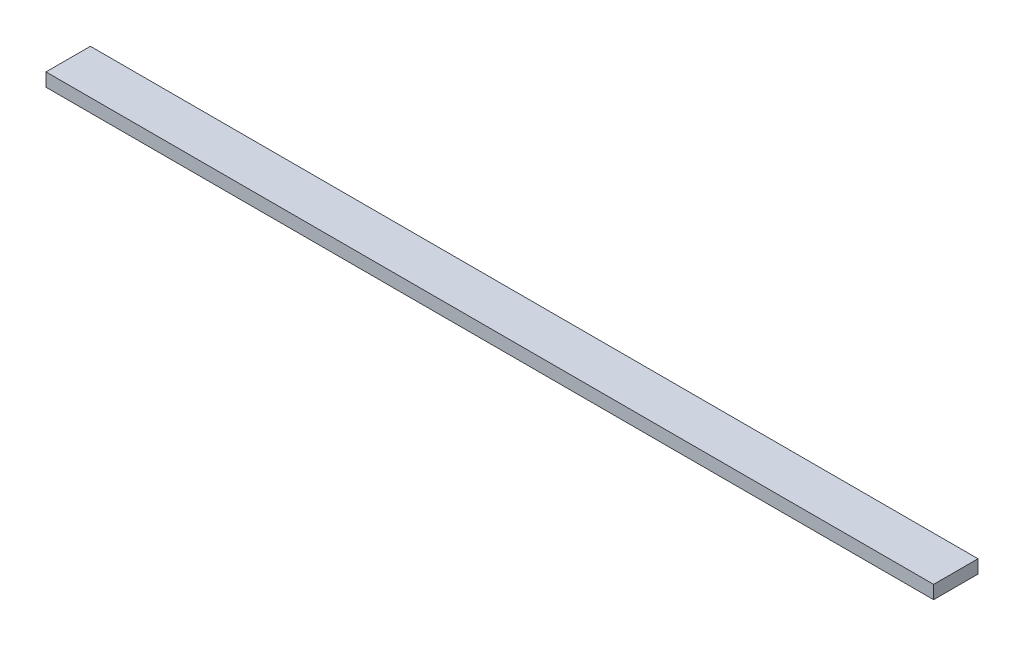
from build123d import *

# Parameters (mm, degrees)
ESQUISSE1_W      = 10000
ESQUISSE1_H      = 150
EXTRUSION1_DEPTH = 500


with BuildPart() as part:
    # Esquisse1 → Extrusion1 (new body)
    with BuildSketch(Plane.XY):
        with Locations((5000, -75)):
            Rectangle(ESQUISSE1_W, ESQUISSE1_H)
    extrude(amount=EXTRUSION1_DEPTH)


solid = part.part
